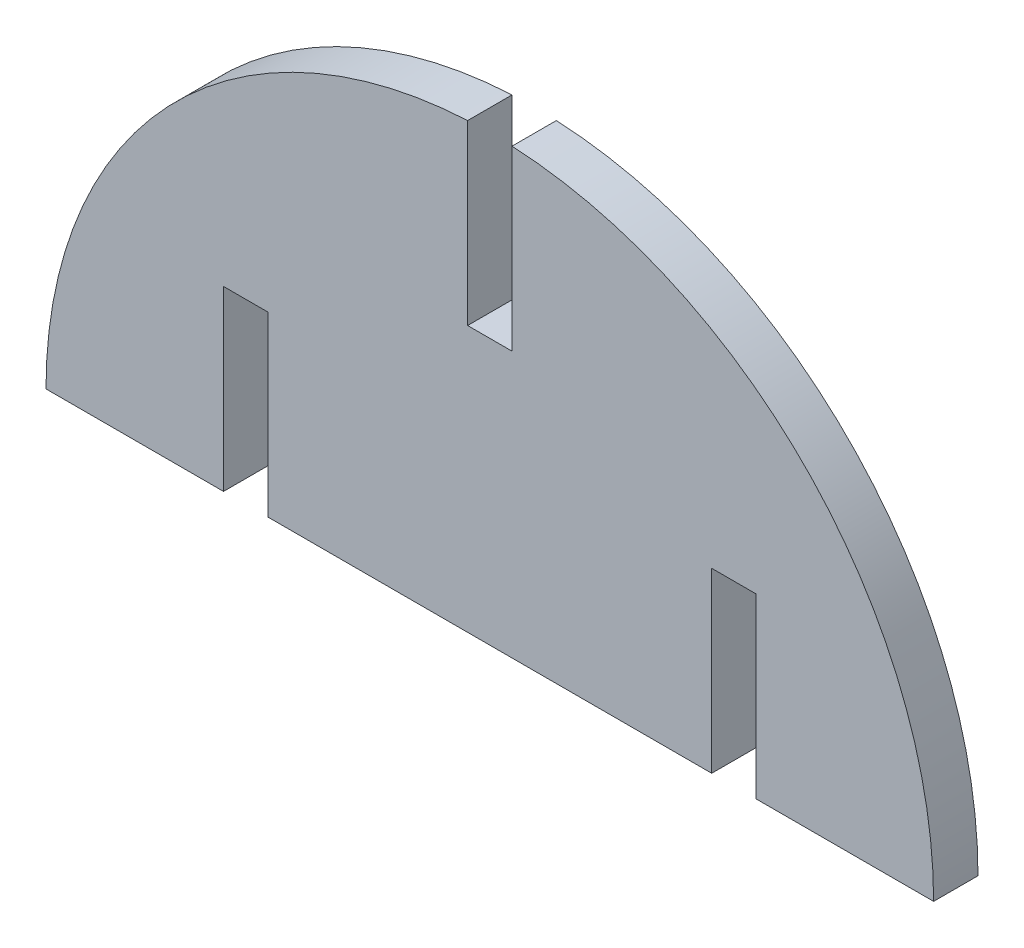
ISO-10303-21;
HEADER;
FILE_DESCRIPTION(('STEP AP214'),'2;1');
FILE_NAME('part.step','',(''),(''),'','','');
FILE_SCHEMA(('AUTOMOTIVE_DESIGN { 1 0 10303 214 1 1 1 1 }'));
ENDSEC;
DATA;
#1=APPLICATION_CONTEXT('core data for automotive mechanical design processes');
#2=APPLICATION_PROTOCOL_DEFINITION('international standard','automotive_design',2000,#1);
#3=PRODUCT_CONTEXT('',#1,'mechanical');
#4=PRODUCT('Part','Part','',(#3));
#5=PRODUCT_RELATED_PRODUCT_CATEGORY('part','',(#4));
#6=PRODUCT_DEFINITION_FORMATION('','',#4);
#7=PRODUCT_DEFINITION_CONTEXT('part definition',#1,'design');
#8=PRODUCT_DEFINITION('design','',#6,#7);
#9=PRODUCT_DEFINITION_SHAPE('','',#8);
#10=(LENGTH_UNIT() NAMED_UNIT(*) SI_UNIT(.MILLI.,.METRE.));
#11=(NAMED_UNIT(*) PLANE_ANGLE_UNIT() SI_UNIT($,.RADIAN.));
#12=(NAMED_UNIT(*) SI_UNIT($,.STERADIAN.) SOLID_ANGLE_UNIT());
#13=UNCERTAINTY_MEASURE_WITH_UNIT(LENGTH_MEASURE(1.E-05),#10,'distance_accuracy_value','');
#14=(GEOMETRIC_REPRESENTATION_CONTEXT(3) GLOBAL_UNCERTAINTY_ASSIGNED_CONTEXT((#13)) GLOBAL_UNIT_ASSIGNED_CONTEXT((#10,
#11,#12)) REPRESENTATION_CONTEXT('',''));
#15=CARTESIAN_POINT('',(0.,0.,0.));
#16=DIRECTION('',(0.,0.,1.));
#17=DIRECTION('',(1.,0.,0.));
#18=AXIS2_PLACEMENT_3D('',#15,#16,#17);
#19=CARTESIAN_POINT('',(0.,0.,2.5));
#20=DIRECTION('',(0.,0.,-1.));
#21=DIRECTION('',(-1.,0.,0.));
#22=AXIS2_PLACEMENT_3D('',#19,#20,#21);
#23=CYLINDRICAL_SURFACE('',#22,25.);
#24=CARTESIAN_POINT('',(0.,0.,2.5));
#25=DIRECTION('',(0.,0.,1.));
#26=DIRECTION('',(1.,0.,0.));
#27=AXIS2_PLACEMENT_3D('',#24,#25,#26);
#28=CIRCLE('',#27,25.);
#29=CARTESIAN_POINT('',(-1.24999999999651,24.9687304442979,2.5));
#30=VERTEX_POINT('',#29);
#31=CARTESIAN_POINT('',(-24.9999999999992,0.,2.5));
#32=VERTEX_POINT('',#31);
#33=EDGE_CURVE('E179',#30,#32,#28,.T.);
#34=ORIENTED_EDGE('',*,*,#33,.F.);
#35=DIRECTION('',(0.,0.,-1.));
#36=VECTOR('',#35,1.);
#37=CARTESIAN_POINT('',(-1.24999999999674,24.9687304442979,2.5));
#38=LINE('',#37,#36);
#39=CARTESIAN_POINT('',(-1.24999999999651,24.9687304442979,0.));
#40=VERTEX_POINT('',#39);
#41=EDGE_CURVE('E70',#30,#40,#38,.T.);
#42=ORIENTED_EDGE('',*,*,#41,.T.);
#43=CARTESIAN_POINT('',(0.,0.,0.));
#44=DIRECTION('',(0.,0.,1.));
#45=DIRECTION('',(1.,0.,0.));
#46=AXIS2_PLACEMENT_3D('',#43,#44,#45);
#47=CIRCLE('',#46,25.);
#48=CARTESIAN_POINT('',(-24.9999999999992,0.,0.));
#49=VERTEX_POINT('',#48);
#50=EDGE_CURVE('E164',#40,#49,#47,.T.);
#51=ORIENTED_EDGE('',*,*,#50,.T.);
#52=DIRECTION('',(0.,0.,-1.));
#53=VECTOR('',#52,1.);
#54=CARTESIAN_POINT('',(-24.9999999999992,0.,2.5));
#55=LINE('',#54,#53);
#56=EDGE_CURVE('E173',#32,#49,#55,.T.);
#57=ORIENTED_EDGE('',*,*,#56,.F.);
#58=EDGE_LOOP('',(#34,#42,#51,#57));
#59=FACE_BOUND('',#58,.T.);
#60=ADVANCED_FACE('F33',(#59),#23,.T.);
#61=CARTESIAN_POINT('',(-24.9999999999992,0.,2.5));
#62=DIRECTION('',(0.,1.,0.));
#63=DIRECTION('',(0.,0.,1.));
#64=AXIS2_PLACEMENT_3D('',#61,#62,#63);
#65=PLANE('',#64);
#66=DIRECTION('',(1.,0.,0.));
#67=VECTOR('',#66,1.);
#68=CARTESIAN_POINT('',(-24.9999999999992,0.,2.5));
#69=LINE('',#68,#67);
#70=CARTESIAN_POINT('',(15.0000000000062,0.,2.5));
#71=VERTEX_POINT('',#70);
#72=CARTESIAN_POINT('',(25.0000000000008,0.,2.5));
#73=VERTEX_POINT('',#72);
#74=EDGE_CURVE('E155',#71,#73,#69,.T.);
#75=ORIENTED_EDGE('',*,*,#74,.F.);
#76=DIRECTION('',(0.,0.,1.));
#77=VECTOR('',#76,1.);
#78=CARTESIAN_POINT('',(15.0000000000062,0.,0.));
#79=LINE('',#78,#77);
#80=CARTESIAN_POINT('',(15.0000000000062,0.,0.));
#81=VERTEX_POINT('',#80);
#82=EDGE_CURVE('E139',#81,#71,#79,.T.);
#83=ORIENTED_EDGE('',*,*,#82,.F.);
#84=DIRECTION('',(1.,0.,0.));
#85=VECTOR('',#84,1.);
#86=CARTESIAN_POINT('',(-24.9999999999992,0.,0.));
#87=LINE('',#86,#85);
#88=CARTESIAN_POINT('',(25.0000000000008,0.,0.));
#89=VERTEX_POINT('',#88);
#90=EDGE_CURVE('E153',#81,#89,#87,.T.);
#91=ORIENTED_EDGE('',*,*,#90,.T.);
#92=DIRECTION('',(0.,0.,-1.));
#93=VECTOR('',#92,1.);
#94=CARTESIAN_POINT('',(25.0000000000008,0.,2.5));
#95=LINE('',#94,#93);
#96=EDGE_CURVE('E189',#73,#89,#95,.T.);
#97=ORIENTED_EDGE('',*,*,#96,.F.);
#98=EDGE_LOOP('',(#75,#83,#91,#97));
#99=FACE_BOUND('',#98,.T.);
#100=ADVANCED_FACE('F151',(#99),#65,.F.);
#101=CARTESIAN_POINT('',(-12.4999999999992,0.,0.));
#102=VERTEX_POINT('',#101);
#103=CARTESIAN_POINT('',(12.5000000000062,0.,0.));
#104=VERTEX_POINT('',#103);
#105=EDGE_CURVE('E163',#102,#104,#87,.T.);
#106=ORIENTED_EDGE('',*,*,#105,.T.);
#107=DIRECTION('',(0.,0.,1.));
#108=VECTOR('',#107,1.);
#109=CARTESIAN_POINT('',(12.5000000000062,0.,0.));
#110=LINE('',#109,#108);
#111=CARTESIAN_POINT('',(12.5000000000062,0.,2.5));
#112=VERTEX_POINT('',#111);
#113=EDGE_CURVE('E168',#104,#112,#110,.T.);
#114=ORIENTED_EDGE('',*,*,#113,.T.);
#115=CARTESIAN_POINT('',(-12.4999999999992,0.,2.5));
#116=VERTEX_POINT('',#115);
#117=EDGE_CURVE('E218',#116,#112,#69,.T.);
#118=ORIENTED_EDGE('',*,*,#117,.F.);
#119=DIRECTION('',(0.,0.,1.));
#120=VECTOR('',#119,1.);
#121=CARTESIAN_POINT('',(-12.4999999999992,0.,0.));
#122=LINE('',#121,#120);
#123=EDGE_CURVE('E193',#102,#116,#122,.T.);
#124=ORIENTED_EDGE('',*,*,#123,.F.);
#125=EDGE_LOOP('',(#106,#114,#118,#124));
#126=FACE_BOUND('',#125,.T.);
#127=ADVANCED_FACE('F263',(#126),#65,.F.);
#128=DIRECTION('',(0.,0.,1.));
#129=VECTOR('',#128,1.);
#130=CARTESIAN_POINT('',(-14.9999999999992,0.,0.));
#131=LINE('',#130,#129);
#132=CARTESIAN_POINT('',(-14.9999999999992,0.,0.));
#133=VERTEX_POINT('',#132);
#134=CARTESIAN_POINT('',(-14.9999999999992,0.,2.5));
#135=VERTEX_POINT('',#134);
#136=EDGE_CURVE('E181',#133,#135,#131,.T.);
#137=ORIENTED_EDGE('',*,*,#136,.T.);
#138=EDGE_CURVE('E219',#32,#135,#69,.T.);
#139=ORIENTED_EDGE('',*,*,#138,.F.);
#140=ORIENTED_EDGE('',*,*,#56,.T.);
#141=EDGE_CURVE('E166',#49,#133,#87,.T.);
#142=ORIENTED_EDGE('',*,*,#141,.T.);
#143=EDGE_LOOP('',(#137,#139,#140,#142));
#144=FACE_BOUND('',#143,.T.);
#145=ADVANCED_FACE('F269',(#144),#65,.F.);
#146=CARTESIAN_POINT('',(0.,0.,2.5));
#147=DIRECTION('',(0.,0.,1.));
#148=DIRECTION('',(1.,0.,0.));
#149=AXIS2_PLACEMENT_3D('',#146,#147,#148);
#150=PLANE('',#149);
#151=DIRECTION('',(1.,0.,0.));
#152=VECTOR('',#151,1.);
#153=CARTESIAN_POINT('',(-1.24999999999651,14.9687304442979,2.5));
#154=LINE('',#153,#152);
#155=CARTESIAN_POINT('',(-1.24999999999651,14.9687304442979,2.5));
#156=VERTEX_POINT('',#155);
#157=CARTESIAN_POINT('',(1.25000000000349,14.9687304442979,2.5));
#158=VERTEX_POINT('',#157);
#159=EDGE_CURVE('E43',#156,#158,#154,.T.);
#160=ORIENTED_EDGE('',*,*,#159,.F.);
#161=DIRECTION('',(0.,1.,0.));
#162=VECTOR('',#161,1.);
#163=CARTESIAN_POINT('',(-1.24999999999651,14.9687304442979,2.5));
#164=LINE('',#163,#162);
#165=EDGE_CURVE('E172',#156,#30,#164,.T.);
#166=ORIENTED_EDGE('',*,*,#165,.T.);
#167=ORIENTED_EDGE('',*,*,#33,.T.);
#168=ORIENTED_EDGE('',*,*,#138,.T.);
#169=DIRECTION('',(0.,1.,0.));
#170=VECTOR('',#169,1.);
#171=CARTESIAN_POINT('',(-14.9999999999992,0.,2.5));
#172=LINE('',#171,#170);
#173=CARTESIAN_POINT('',(-14.9999999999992,10.,2.5));
#174=VERTEX_POINT('',#173);
#175=EDGE_CURVE('E221',#135,#174,#172,.T.);
#176=ORIENTED_EDGE('',*,*,#175,.T.);
#177=DIRECTION('',(1.,0.,0.));
#178=VECTOR('',#177,1.);
#179=CARTESIAN_POINT('',(0.,10.,2.5));
#180=LINE('',#179,#178);
#181=CARTESIAN_POINT('',(-12.4999999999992,10.,2.5));
#182=VERTEX_POINT('',#181);
#183=EDGE_CURVE('E223',#174,#182,#180,.T.);
#184=ORIENTED_EDGE('',*,*,#183,.T.);
#185=DIRECTION('',(0.,-1.,0.));
#186=VECTOR('',#185,1.);
#187=CARTESIAN_POINT('',(-12.4999999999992,0.,2.5));
#188=LINE('',#187,#186);
#189=EDGE_CURVE('E227',#182,#116,#188,.T.);
#190=ORIENTED_EDGE('',*,*,#189,.T.);
#191=ORIENTED_EDGE('',*,*,#117,.T.);
#192=DIRECTION('',(0.,-1.,0.));
#193=VECTOR('',#192,1.);
#194=CARTESIAN_POINT('',(12.5000000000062,0.,2.5));
#195=LINE('',#194,#193);
#196=CARTESIAN_POINT('',(12.5000000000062,10.,2.5));
#197=VERTEX_POINT('',#196);
#198=EDGE_CURVE('E156',#197,#112,#195,.T.);
#199=ORIENTED_EDGE('',*,*,#198,.F.);
#200=DIRECTION('',(-1.,0.,0.));
#201=VECTOR('',#200,1.);
#202=CARTESIAN_POINT('',(0.,10.,2.5));
#203=LINE('',#202,#201);
#204=CARTESIAN_POINT('',(15.0000000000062,10.,2.5));
#205=VERTEX_POINT('',#204);
#206=EDGE_CURVE('E247',#205,#197,#203,.T.);
#207=ORIENTED_EDGE('',*,*,#206,.F.);
#208=DIRECTION('',(0.,1.,0.));
#209=VECTOR('',#208,1.);
#210=CARTESIAN_POINT('',(15.0000000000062,0.,2.5));
#211=LINE('',#210,#209);
#212=EDGE_CURVE('E157',#71,#205,#211,.T.);
#213=ORIENTED_EDGE('',*,*,#212,.F.);
#214=ORIENTED_EDGE('',*,*,#74,.T.);
#215=CARTESIAN_POINT('',(1.25000000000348,24.9687304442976,2.5));
#216=VERTEX_POINT('',#215);
#217=EDGE_CURVE('E215',#73,#216,#28,.T.);
#218=ORIENTED_EDGE('',*,*,#217,.T.);
#219=DIRECTION('',(0.,1.,0.));
#220=VECTOR('',#219,1.);
#221=CARTESIAN_POINT('',(1.25000000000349,14.9687304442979,2.5));
#222=LINE('',#221,#220);
#223=EDGE_CURVE('E206',#158,#216,#222,.T.);
#224=ORIENTED_EDGE('',*,*,#223,.F.);
#225=EDGE_LOOP('',(#160,#166,#167,#168,#176,#184,#190,#191,#199,#207,#213,#214,#218,#224));
#226=FACE_BOUND('',#225,.T.);
#227=ADVANCED_FACE('F35',(#226),#150,.T.);
#228=CARTESIAN_POINT('',(0.,0.,0.));
#229=DIRECTION('',(0.,0.,1.));
#230=DIRECTION('',(1.,0.,0.));
#231=AXIS2_PLACEMENT_3D('',#228,#229,#230);
#232=PLANE('',#231);
#233=DIRECTION('',(0.,1.,0.));
#234=VECTOR('',#233,1.);
#235=CARTESIAN_POINT('',(-1.24999999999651,14.9687304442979,0.));
#236=LINE('',#235,#234);
#237=CARTESIAN_POINT('',(-1.24999999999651,14.9687304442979,0.));
#238=VERTEX_POINT('',#237);
#239=EDGE_CURVE('E67',#238,#40,#236,.T.);
#240=ORIENTED_EDGE('',*,*,#239,.F.);
#241=DIRECTION('',(1.,0.,0.));
#242=VECTOR('',#241,1.);
#243=CARTESIAN_POINT('',(-1.24999999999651,14.9687304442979,0.));
#244=LINE('',#243,#242);
#245=CARTESIAN_POINT('',(1.25000000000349,14.9687304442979,0.));
#246=VERTEX_POINT('',#245);
#247=EDGE_CURVE('E213',#238,#246,#244,.T.);
#248=ORIENTED_EDGE('',*,*,#247,.T.);
#249=DIRECTION('',(0.,1.,0.));
#250=VECTOR('',#249,1.);
#251=CARTESIAN_POINT('',(1.25000000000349,14.9687304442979,0.));
#252=LINE('',#251,#250);
#253=CARTESIAN_POINT('',(1.25000000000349,24.9687304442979,0.));
#254=VERTEX_POINT('',#253);
#255=EDGE_CURVE('E147',#246,#254,#252,.T.);
#256=ORIENTED_EDGE('',*,*,#255,.T.);
#257=EDGE_CURVE('E37',#89,#254,#47,.T.);
#258=ORIENTED_EDGE('',*,*,#257,.F.);
#259=ORIENTED_EDGE('',*,*,#90,.F.);
#260=DIRECTION('',(0.,1.,0.));
#261=VECTOR('',#260,1.);
#262=CARTESIAN_POINT('',(15.0000000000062,0.,0.));
#263=LINE('',#262,#261);
#264=CARTESIAN_POINT('',(15.0000000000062,10.,0.));
#265=VERTEX_POINT('',#264);
#266=EDGE_CURVE('E135',#81,#265,#263,.T.);
#267=ORIENTED_EDGE('',*,*,#266,.T.);
#268=DIRECTION('',(-1.,0.,0.));
#269=VECTOR('',#268,1.);
#270=CARTESIAN_POINT('',(0.,10.,0.));
#271=LINE('',#270,#269);
#272=CARTESIAN_POINT('',(12.5000000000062,10.,0.));
#273=VERTEX_POINT('',#272);
#274=EDGE_CURVE('E146',#265,#273,#271,.T.);
#275=ORIENTED_EDGE('',*,*,#274,.T.);
#276=DIRECTION('',(0.,-1.,0.));
#277=VECTOR('',#276,1.);
#278=CARTESIAN_POINT('',(12.5000000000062,0.,0.));
#279=LINE('',#278,#277);
#280=EDGE_CURVE('E197',#273,#104,#279,.T.);
#281=ORIENTED_EDGE('',*,*,#280,.T.);
#282=ORIENTED_EDGE('',*,*,#105,.F.);
#283=DIRECTION('',(0.,-1.,0.));
#284=VECTOR('',#283,1.);
#285=CARTESIAN_POINT('',(-12.4999999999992,0.,0.));
#286=LINE('',#285,#284);
#287=CARTESIAN_POINT('',(-12.4999999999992,10.,0.));
#288=VERTEX_POINT('',#287);
#289=EDGE_CURVE('E190',#288,#102,#286,.T.);
#290=ORIENTED_EDGE('',*,*,#289,.F.);
#291=DIRECTION('',(1.,0.,0.));
#292=VECTOR('',#291,1.);
#293=CARTESIAN_POINT('',(0.,10.,0.));
#294=LINE('',#293,#292);
#295=CARTESIAN_POINT('',(-14.9999999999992,10.,0.));
#296=VERTEX_POINT('',#295);
#297=EDGE_CURVE('E240',#296,#288,#294,.T.);
#298=ORIENTED_EDGE('',*,*,#297,.F.);
#299=DIRECTION('',(0.,1.,0.));
#300=VECTOR('',#299,1.);
#301=CARTESIAN_POINT('',(-14.9999999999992,0.,0.));
#302=LINE('',#301,#300);
#303=EDGE_CURVE('E236',#133,#296,#302,.T.);
#304=ORIENTED_EDGE('',*,*,#303,.F.);
#305=ORIENTED_EDGE('',*,*,#141,.F.);
#306=ORIENTED_EDGE('',*,*,#50,.F.);
#307=EDGE_LOOP('',(#240,#248,#256,#258,#259,#267,#275,#281,#282,#290,#298,#304,#305,#306));
#308=FACE_BOUND('',#307,.T.);
#309=ADVANCED_FACE('F160',(#308),#232,.F.);
#310=ORIENTED_EDGE('',*,*,#257,.T.);
#311=DIRECTION('',(0.,0.,-1.));
#312=VECTOR('',#311,1.);
#313=CARTESIAN_POINT('',(1.25000000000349,24.9687304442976,2.5));
#314=LINE('',#313,#312);
#315=EDGE_CURVE('E187',#254,#216,#314,.F.);
#316=ORIENTED_EDGE('',*,*,#315,.T.);
#317=ORIENTED_EDGE('',*,*,#217,.F.);
#318=ORIENTED_EDGE('',*,*,#96,.T.);
#319=EDGE_LOOP('',(#310,#316,#317,#318));
#320=FACE_BOUND('',#319,.T.);
#321=ADVANCED_FACE('F289',(#320),#23,.T.);
#322=CARTESIAN_POINT('',(-12.4999999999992,0.,0.));
#323=DIRECTION('',(-1.,0.,0.));
#324=DIRECTION('',(0.,0.,1.));
#325=AXIS2_PLACEMENT_3D('',#322,#323,#324);
#326=PLANE('',#325);
#327=ORIENTED_EDGE('',*,*,#189,.F.);
#328=DIRECTION('',(0.,0.,1.));
#329=VECTOR('',#328,1.);
#330=CARTESIAN_POINT('',(-12.4999999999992,10.,0.));
#331=LINE('',#330,#329);
#332=EDGE_CURVE('E241',#288,#182,#331,.T.);
#333=ORIENTED_EDGE('',*,*,#332,.F.);
#334=ORIENTED_EDGE('',*,*,#289,.T.);
#335=ORIENTED_EDGE('',*,*,#123,.T.);
#336=EDGE_LOOP('',(#327,#333,#334,#335));
#337=FACE_BOUND('',#336,.T.);
#338=ADVANCED_FACE('F260',(#337),#326,.T.);
#339=CARTESIAN_POINT('',(-14.9999999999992,0.,0.));
#340=DIRECTION('',(1.,0.,0.));
#341=DIRECTION('',(0.,1.,0.));
#342=AXIS2_PLACEMENT_3D('',#339,#340,#341);
#343=PLANE('',#342);
#344=ORIENTED_EDGE('',*,*,#175,.F.);
#345=ORIENTED_EDGE('',*,*,#136,.F.);
#346=ORIENTED_EDGE('',*,*,#303,.T.);
#347=DIRECTION('',(0.,0.,1.));
#348=VECTOR('',#347,1.);
#349=CARTESIAN_POINT('',(-14.9999999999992,10.,0.));
#350=LINE('',#349,#348);
#351=EDGE_CURVE('E239',#296,#174,#350,.T.);
#352=ORIENTED_EDGE('',*,*,#351,.T.);
#353=EDGE_LOOP('',(#344,#345,#346,#352));
#354=FACE_BOUND('',#353,.T.);
#355=ADVANCED_FACE('F268',(#354),#343,.T.);
#356=CARTESIAN_POINT('',(0.,10.,0.));
#357=DIRECTION('',(0.,-1.,0.));
#358=DIRECTION('',(1.,0.,0.));
#359=AXIS2_PLACEMENT_3D('',#356,#357,#358);
#360=PLANE('',#359);
#361=ORIENTED_EDGE('',*,*,#183,.F.);
#362=ORIENTED_EDGE('',*,*,#351,.F.);
#363=ORIENTED_EDGE('',*,*,#297,.T.);
#364=ORIENTED_EDGE('',*,*,#332,.T.);
#365=EDGE_LOOP('',(#361,#362,#363,#364));
#366=FACE_BOUND('',#365,.T.);
#367=ADVANCED_FACE('F266',(#366),#360,.T.);
#368=CARTESIAN_POINT('',(0.,10.,0.));
#369=DIRECTION('',(0.,1.,0.));
#370=DIRECTION('',(-1.,0.,0.));
#371=AXIS2_PLACEMENT_3D('',#368,#369,#370);
#372=PLANE('',#371);
#373=ORIENTED_EDGE('',*,*,#206,.T.);
#374=DIRECTION('',(0.,0.,1.));
#375=VECTOR('',#374,1.);
#376=CARTESIAN_POINT('',(12.5000000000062,10.,0.));
#377=LINE('',#376,#375);
#378=EDGE_CURVE('E209',#273,#197,#377,.T.);
#379=ORIENTED_EDGE('',*,*,#378,.F.);
#380=ORIENTED_EDGE('',*,*,#274,.F.);
#381=DIRECTION('',(0.,0.,1.));
#382=VECTOR('',#381,1.);
#383=CARTESIAN_POINT('',(15.0000000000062,10.,0.));
#384=LINE('',#383,#382);
#385=EDGE_CURVE('E141',#265,#205,#384,.T.);
#386=ORIENTED_EDGE('',*,*,#385,.T.);
#387=EDGE_LOOP('',(#373,#379,#380,#386));
#388=FACE_BOUND('',#387,.T.);
#389=ADVANCED_FACE('F312',(#388),#372,.F.);
#390=CARTESIAN_POINT('',(15.0000000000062,0.,0.));
#391=DIRECTION('',(1.,0.,0.));
#392=DIRECTION('',(0.,1.,0.));
#393=AXIS2_PLACEMENT_3D('',#390,#391,#392);
#394=PLANE('',#393);
#395=ORIENTED_EDGE('',*,*,#212,.T.);
#396=ORIENTED_EDGE('',*,*,#385,.F.);
#397=ORIENTED_EDGE('',*,*,#266,.F.);
#398=ORIENTED_EDGE('',*,*,#82,.T.);
#399=EDGE_LOOP('',(#395,#396,#397,#398));
#400=FACE_BOUND('',#399,.T.);
#401=ADVANCED_FACE('F138',(#400),#394,.F.);
#402=CARTESIAN_POINT('',(12.5000000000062,0.,0.));
#403=DIRECTION('',(-1.,0.,0.));
#404=DIRECTION('',(0.,0.,1.));
#405=AXIS2_PLACEMENT_3D('',#402,#403,#404);
#406=PLANE('',#405);
#407=ORIENTED_EDGE('',*,*,#198,.T.);
#408=ORIENTED_EDGE('',*,*,#113,.F.);
#409=ORIENTED_EDGE('',*,*,#280,.F.);
#410=ORIENTED_EDGE('',*,*,#378,.T.);
#411=EDGE_LOOP('',(#407,#408,#409,#410));
#412=FACE_BOUND('',#411,.T.);
#413=ADVANCED_FACE('F285',(#412),#406,.F.);
#414=CARTESIAN_POINT('',(1.25000000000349,14.9687304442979,0.));
#415=DIRECTION('',(1.,0.,0.));
#416=DIRECTION('',(0.,0.,-1.));
#417=AXIS2_PLACEMENT_3D('',#414,#415,#416);
#418=PLANE('',#417);
#419=ORIENTED_EDGE('',*,*,#223,.T.);
#420=ORIENTED_EDGE('',*,*,#315,.F.);
#421=ORIENTED_EDGE('',*,*,#255,.F.);
#422=DIRECTION('',(0.,0.,1.));
#423=VECTOR('',#422,1.);
#424=CARTESIAN_POINT('',(1.25000000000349,14.9687304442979,0.));
#425=LINE('',#424,#423);
#426=EDGE_CURVE('E205',#246,#158,#425,.T.);
#427=ORIENTED_EDGE('',*,*,#426,.T.);
#428=EDGE_LOOP('',(#419,#420,#421,#427));
#429=FACE_BOUND('',#428,.T.);
#430=ADVANCED_FACE('F276',(#429),#418,.F.);
#431=CARTESIAN_POINT('',(-1.24999999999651,14.9687304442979,0.));
#432=DIRECTION('',(1.,0.,0.));
#433=DIRECTION('',(0.,0.,-1.));
#434=AXIS2_PLACEMENT_3D('',#431,#432,#433);
#435=PLANE('',#434);
#436=ORIENTED_EDGE('',*,*,#165,.F.);
#437=DIRECTION('',(0.,0.,1.));
#438=VECTOR('',#437,1.);
#439=CARTESIAN_POINT('',(-1.24999999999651,14.9687304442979,0.));
#440=LINE('',#439,#438);
#441=EDGE_CURVE('E11',#238,#156,#440,.T.);
#442=ORIENTED_EDGE('',*,*,#441,.F.);
#443=ORIENTED_EDGE('',*,*,#239,.T.);
#444=ORIENTED_EDGE('',*,*,#41,.F.);
#445=EDGE_LOOP('',(#436,#442,#443,#444));
#446=FACE_BOUND('',#445,.T.);
#447=ADVANCED_FACE('F277',(#446),#435,.T.);
#448=CARTESIAN_POINT('',(-1.24999999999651,14.9687304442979,0.));
#449=DIRECTION('',(0.,-1.,0.));
#450=DIRECTION('',(0.,0.,-1.));
#451=AXIS2_PLACEMENT_3D('',#448,#449,#450);
#452=PLANE('',#451);
#453=ORIENTED_EDGE('',*,*,#159,.T.);
#454=ORIENTED_EDGE('',*,*,#426,.F.);
#455=ORIENTED_EDGE('',*,*,#247,.F.);
#456=ORIENTED_EDGE('',*,*,#441,.T.);
#457=EDGE_LOOP('',(#453,#454,#455,#456));
#458=FACE_BOUND('',#457,.T.);
#459=ADVANCED_FACE('F273',(#458),#452,.F.);
#460=CLOSED_SHELL('',(#60,#100,#127,#145,#227,#309,#321,#338,#355,#367,#389,#401,#413,#430,#447,#459));
#461=MANIFOLD_SOLID_BREP('B2',#460);
#462=ADVANCED_BREP_SHAPE_REPRESENTATION('',(#18,#461),#14);
#463=SHAPE_DEFINITION_REPRESENTATION(#9,#462);
ENDSEC;
END-ISO-10303-21;
